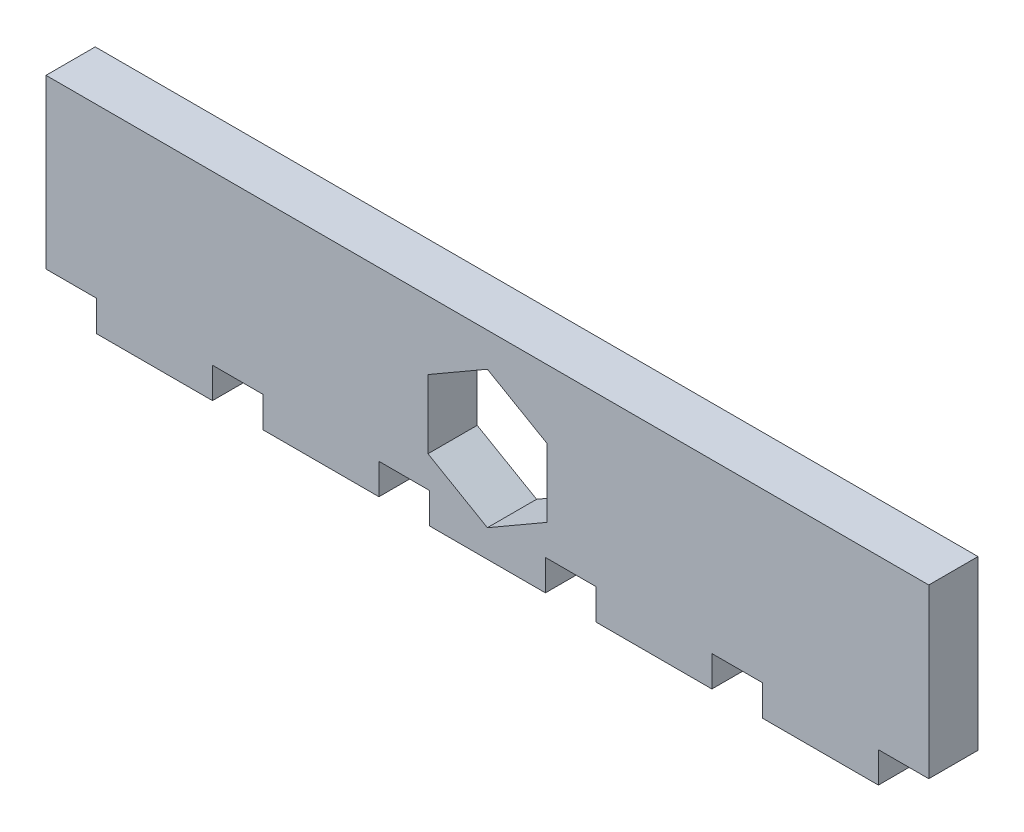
ISO-10303-21;
HEADER;
FILE_DESCRIPTION(('STEP AP214'),'2;1');
FILE_NAME('part.step','',(''),(''),'','','');
FILE_SCHEMA(('AUTOMOTIVE_DESIGN { 1 0 10303 214 1 1 1 1 }'));
ENDSEC;
DATA;
#1=APPLICATION_CONTEXT('core data for automotive mechanical design processes');
#2=APPLICATION_PROTOCOL_DEFINITION('international standard','automotive_design',2000,#1);
#3=PRODUCT_CONTEXT('',#1,'mechanical');
#4=PRODUCT('Part','Part','',(#3));
#5=PRODUCT_RELATED_PRODUCT_CATEGORY('part','',(#4));
#6=PRODUCT_DEFINITION_FORMATION('','',#4);
#7=PRODUCT_DEFINITION_CONTEXT('part definition',#1,'design');
#8=PRODUCT_DEFINITION('design','',#6,#7);
#9=PRODUCT_DEFINITION_SHAPE('','',#8);
#10=(LENGTH_UNIT() NAMED_UNIT(*) SI_UNIT(.MILLI.,.METRE.));
#11=(NAMED_UNIT(*) PLANE_ANGLE_UNIT() SI_UNIT($,.RADIAN.));
#12=(NAMED_UNIT(*) SI_UNIT($,.STERADIAN.) SOLID_ANGLE_UNIT());
#13=UNCERTAINTY_MEASURE_WITH_UNIT(LENGTH_MEASURE(1.E-05),#10,'distance_accuracy_value','');
#14=(GEOMETRIC_REPRESENTATION_CONTEXT(3) GLOBAL_UNCERTAINTY_ASSIGNED_CONTEXT((#13)) GLOBAL_UNIT_ASSIGNED_CONTEXT((#10,
#11,#12)) REPRESENTATION_CONTEXT('',''));
#15=CARTESIAN_POINT('',(0.,0.,0.));
#16=DIRECTION('',(0.,0.,1.));
#17=DIRECTION('',(1.,0.,0.));
#18=AXIS2_PLACEMENT_3D('',#15,#16,#17);
#19=CARTESIAN_POINT('',(0.,0.,5.3848));
#20=DIRECTION('',(0.,0.,-1.));
#21=DIRECTION('',(-1.,0.,0.));
#22=AXIS2_PLACEMENT_3D('',#19,#20,#21);
#23=PLANE('',#22);
#24=DIRECTION('',(0.,1.,0.));
#25=VECTOR('',#24,1.);
#26=CARTESIAN_POINT('',(209.670480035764,240.672505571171,5.3848));
#27=LINE('',#26,#25);
#28=CARTESIAN_POINT('',(209.670480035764,237.313031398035,5.3848));
#29=VERTEX_POINT('',#28);
#30=CARTESIAN_POINT('',(209.670480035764,240.672505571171,5.3848));
#31=VERTEX_POINT('',#30);
#32=EDGE_CURVE('E280',#29,#31,#27,.T.);
#33=ORIENTED_EDGE('',*,*,#32,.T.);
#34=DIRECTION('',(1.,0.,0.));
#35=VECTOR('',#34,1.);
#36=CARTESIAN_POINT('',(215.182280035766,240.672505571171,5.3848));
#37=LINE('',#36,#35);
#38=CARTESIAN_POINT('',(215.182280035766,240.672505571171,5.3848));
#39=VERTEX_POINT('',#38);
#40=EDGE_CURVE('E283',#31,#39,#37,.T.);
#41=ORIENTED_EDGE('',*,*,#40,.T.);
#42=DIRECTION('',(0.,1.,0.));
#43=VECTOR('',#42,1.);
#44=CARTESIAN_POINT('',(215.182280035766,240.672505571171,5.3848));
#45=LINE('',#44,#43);
#46=CARTESIAN_POINT('',(215.182280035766,259.030257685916,5.3848));
#47=VERTEX_POINT('',#46);
#48=EDGE_CURVE('E286',#39,#47,#45,.T.);
#49=ORIENTED_EDGE('',*,*,#48,.T.);
#50=DIRECTION('',(-1.,0.,0.));
#51=VECTOR('',#50,1.);
#52=CARTESIAN_POINT('',(215.182280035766,259.030257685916,5.3848));
#53=LINE('',#52,#51);
#54=CARTESIAN_POINT('',(118.611480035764,259.030257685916,5.3848));
#55=VERTEX_POINT('',#54);
#56=EDGE_CURVE('E288',#47,#55,#53,.T.);
#57=ORIENTED_EDGE('',*,*,#56,.T.);
#58=DIRECTION('',(0.,-1.,0.));
#59=VECTOR('',#58,1.);
#60=CARTESIAN_POINT('',(118.611480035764,240.672505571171,5.3848));
#61=LINE('',#60,#59);
#62=CARTESIAN_POINT('',(118.611480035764,240.672505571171,5.3848));
#63=VERTEX_POINT('',#62);
#64=EDGE_CURVE('E290',#55,#63,#61,.T.);
#65=ORIENTED_EDGE('',*,*,#64,.T.);
#66=DIRECTION('',(1.,0.,0.));
#67=VECTOR('',#66,1.);
#68=CARTESIAN_POINT('',(124.123280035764,240.672505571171,5.3848));
#69=LINE('',#68,#67);
#70=CARTESIAN_POINT('',(124.123280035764,240.672505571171,5.3848));
#71=VERTEX_POINT('',#70);
#72=EDGE_CURVE('E292',#63,#71,#69,.T.);
#73=ORIENTED_EDGE('',*,*,#72,.T.);
#74=DIRECTION('',(0.,-1.,0.));
#75=VECTOR('',#74,1.);
#76=CARTESIAN_POINT('',(124.123280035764,237.313031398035,5.3848));
#77=LINE('',#76,#75);
#78=CARTESIAN_POINT('',(124.123280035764,237.313031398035,5.3848));
#79=VERTEX_POINT('',#78);
#80=EDGE_CURVE('E294',#71,#79,#77,.T.);
#81=ORIENTED_EDGE('',*,*,#80,.T.);
#82=DIRECTION('',(1.,0.,0.));
#83=VECTOR('',#82,1.);
#84=CARTESIAN_POINT('',(136.823280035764,237.313031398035,5.3848));
#85=LINE('',#84,#83);
#86=CARTESIAN_POINT('',(136.823280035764,237.313031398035,5.3848));
#87=VERTEX_POINT('',#86);
#88=EDGE_CURVE('E296',#79,#87,#85,.T.);
#89=ORIENTED_EDGE('',*,*,#88,.T.);
#90=DIRECTION('',(0.,1.,0.));
#91=VECTOR('',#90,1.);
#92=CARTESIAN_POINT('',(136.823280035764,240.672505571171,5.3848));
#93=LINE('',#92,#91);
#94=CARTESIAN_POINT('',(136.823280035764,240.672505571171,5.3848));
#95=VERTEX_POINT('',#94);
#96=EDGE_CURVE('E298',#87,#95,#93,.T.);
#97=ORIENTED_EDGE('',*,*,#96,.T.);
#98=DIRECTION('',(1.,0.,0.));
#99=VECTOR('',#98,1.);
#100=CARTESIAN_POINT('',(142.335080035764,240.672505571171,5.3848));
#101=LINE('',#100,#99);
#102=CARTESIAN_POINT('',(142.335080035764,240.672505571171,5.3848));
#103=VERTEX_POINT('',#102);
#104=EDGE_CURVE('E300',#95,#103,#101,.T.);
#105=ORIENTED_EDGE('',*,*,#104,.T.);
#106=DIRECTION('',(0.,-1.,0.));
#107=VECTOR('',#106,1.);
#108=CARTESIAN_POINT('',(142.335080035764,237.313031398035,5.3848));
#109=LINE('',#108,#107);
#110=CARTESIAN_POINT('',(142.335080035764,237.313031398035,5.3848));
#111=VERTEX_POINT('',#110);
#112=EDGE_CURVE('E302',#103,#111,#109,.T.);
#113=ORIENTED_EDGE('',*,*,#112,.T.);
#114=DIRECTION('',(1.,0.,0.));
#115=VECTOR('',#114,1.);
#116=CARTESIAN_POINT('',(155.035080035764,237.313031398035,5.3848));
#117=LINE('',#116,#115);
#118=CARTESIAN_POINT('',(155.035080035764,237.313031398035,5.3848));
#119=VERTEX_POINT('',#118);
#120=EDGE_CURVE('E304',#111,#119,#117,.T.);
#121=ORIENTED_EDGE('',*,*,#120,.T.);
#122=DIRECTION('',(0.,1.,0.));
#123=VECTOR('',#122,1.);
#124=CARTESIAN_POINT('',(155.035080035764,240.672505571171,5.3848));
#125=LINE('',#124,#123);
#126=CARTESIAN_POINT('',(155.035080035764,240.672505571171,5.3848));
#127=VERTEX_POINT('',#126);
#128=EDGE_CURVE('E306',#119,#127,#125,.T.);
#129=ORIENTED_EDGE('',*,*,#128,.T.);
#130=DIRECTION('',(1.,0.,0.));
#131=VECTOR('',#130,1.);
#132=CARTESIAN_POINT('',(160.546880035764,240.672505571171,5.3848));
#133=LINE('',#132,#131);
#134=CARTESIAN_POINT('',(160.546880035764,240.672505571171,5.3848));
#135=VERTEX_POINT('',#134);
#136=EDGE_CURVE('E308',#127,#135,#133,.T.);
#137=ORIENTED_EDGE('',*,*,#136,.T.);
#138=DIRECTION('',(0.,-1.,0.));
#139=VECTOR('',#138,1.);
#140=CARTESIAN_POINT('',(160.546880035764,237.313031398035,5.3848));
#141=LINE('',#140,#139);
#142=CARTESIAN_POINT('',(160.546880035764,237.313031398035,5.3848));
#143=VERTEX_POINT('',#142);
#144=EDGE_CURVE('E310',#135,#143,#141,.T.);
#145=ORIENTED_EDGE('',*,*,#144,.T.);
#146=DIRECTION('',(1.,0.,0.));
#147=VECTOR('',#146,1.);
#148=CARTESIAN_POINT('',(173.246880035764,237.313031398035,5.3848));
#149=LINE('',#148,#147);
#150=CARTESIAN_POINT('',(173.246880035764,237.313031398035,5.3848));
#151=VERTEX_POINT('',#150);
#152=EDGE_CURVE('E312',#143,#151,#149,.T.);
#153=ORIENTED_EDGE('',*,*,#152,.T.);
#154=DIRECTION('',(0.,1.,0.));
#155=VECTOR('',#154,1.);
#156=CARTESIAN_POINT('',(173.246880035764,240.672505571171,5.3848));
#157=LINE('',#156,#155);
#158=CARTESIAN_POINT('',(173.246880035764,240.672505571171,5.3848));
#159=VERTEX_POINT('',#158);
#160=EDGE_CURVE('E314',#151,#159,#157,.T.);
#161=ORIENTED_EDGE('',*,*,#160,.T.);
#162=DIRECTION('',(1.,0.,0.));
#163=VECTOR('',#162,1.);
#164=CARTESIAN_POINT('',(178.758680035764,240.672505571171,5.3848));
#165=LINE('',#164,#163);
#166=CARTESIAN_POINT('',(178.758680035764,240.672505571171,5.3848));
#167=VERTEX_POINT('',#166);
#168=EDGE_CURVE('E316',#159,#167,#165,.T.);
#169=ORIENTED_EDGE('',*,*,#168,.T.);
#170=DIRECTION('',(0.,-1.,0.));
#171=VECTOR('',#170,1.);
#172=CARTESIAN_POINT('',(178.758680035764,237.313031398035,5.3848));
#173=LINE('',#172,#171);
#174=CARTESIAN_POINT('',(178.758680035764,237.313031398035,5.3848));
#175=VERTEX_POINT('',#174);
#176=EDGE_CURVE('E318',#167,#175,#173,.T.);
#177=ORIENTED_EDGE('',*,*,#176,.T.);
#178=DIRECTION('',(1.,0.,0.));
#179=VECTOR('',#178,1.);
#180=CARTESIAN_POINT('',(191.458680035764,237.313031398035,5.3848));
#181=LINE('',#180,#179);
#182=CARTESIAN_POINT('',(191.458680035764,237.313031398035,5.3848));
#183=VERTEX_POINT('',#182);
#184=EDGE_CURVE('E320',#175,#183,#181,.T.);
#185=ORIENTED_EDGE('',*,*,#184,.T.);
#186=DIRECTION('',(0.,1.,0.));
#187=VECTOR('',#186,1.);
#188=CARTESIAN_POINT('',(191.458680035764,240.672505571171,5.3848));
#189=LINE('',#188,#187);
#190=CARTESIAN_POINT('',(191.458680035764,240.672505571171,5.3848));
#191=VERTEX_POINT('',#190);
#192=EDGE_CURVE('E322',#183,#191,#189,.T.);
#193=ORIENTED_EDGE('',*,*,#192,.T.);
#194=DIRECTION('',(1.,0.,0.));
#195=VECTOR('',#194,1.);
#196=CARTESIAN_POINT('',(196.970480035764,240.672505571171,5.3848));
#197=LINE('',#196,#195);
#198=CARTESIAN_POINT('',(196.970480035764,240.672505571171,5.3848));
#199=VERTEX_POINT('',#198);
#200=EDGE_CURVE('E324',#191,#199,#197,.T.);
#201=ORIENTED_EDGE('',*,*,#200,.T.);
#202=DIRECTION('',(0.,-1.,0.));
#203=VECTOR('',#202,1.);
#204=CARTESIAN_POINT('',(196.970480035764,237.313031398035,5.3848));
#205=LINE('',#204,#203);
#206=CARTESIAN_POINT('',(196.970480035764,237.313031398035,5.3848));
#207=VERTEX_POINT('',#206);
#208=EDGE_CURVE('E326',#199,#207,#205,.T.);
#209=ORIENTED_EDGE('',*,*,#208,.T.);
#210=DIRECTION('',(1.,0.,0.));
#211=VECTOR('',#210,1.);
#212=CARTESIAN_POINT('',(209.670480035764,237.313031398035,5.3848));
#213=LINE('',#212,#211);
#214=EDGE_CURVE('E328',#207,#29,#213,.T.);
#215=ORIENTED_EDGE('',*,*,#214,.T.);
#216=EDGE_LOOP('',(#33,#41,#49,#57,#65,#73,#81,#89,#97,#105,#113,#121,#129,#137,#145,#153,#161,
#169,#177,#185,#193,#201,#209,#215));
#217=FACE_BOUND('',#216,.T.);
#218=DIRECTION('',(-0.866025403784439,0.5,0.));
#219=VECTOR('',#218,1.);
#220=CARTESIAN_POINT('',(173.396880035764,251.573156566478,5.3848));
#221=LINE('',#220,#219);
#222=CARTESIAN_POINT('',(173.396880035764,251.573156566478,5.3848));
#223=VERTEX_POINT('',#222);
#224=CARTESIAN_POINT('',(166.896880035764,255.32593331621,5.3848));
#225=VERTEX_POINT('',#224);
#226=EDGE_CURVE('E229',#223,#225,#221,.T.);
#227=ORIENTED_EDGE('',*,*,#226,.F.);
#228=DIRECTION('',(0.,1.,0.));
#229=VECTOR('',#228,1.);
#230=CARTESIAN_POINT('',(173.396880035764,244.067603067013,5.3848));
#231=LINE('',#230,#229);
#232=CARTESIAN_POINT('',(173.396880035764,244.067603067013,5.3848));
#233=VERTEX_POINT('',#232);
#234=EDGE_CURVE('E258',#233,#223,#231,.T.);
#235=ORIENTED_EDGE('',*,*,#234,.F.);
#236=DIRECTION('',(0.866025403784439,0.5,0.));
#237=VECTOR('',#236,1.);
#238=CARTESIAN_POINT('',(166.896880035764,240.31482631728,5.3848));
#239=LINE('',#238,#237);
#240=CARTESIAN_POINT('',(166.896880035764,240.31482631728,5.3848));
#241=VERTEX_POINT('',#240);
#242=EDGE_CURVE('E256',#241,#233,#239,.T.);
#243=ORIENTED_EDGE('',*,*,#242,.F.);
#244=DIRECTION('',(0.866025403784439,-0.5,0.));
#245=VECTOR('',#244,1.);
#246=CARTESIAN_POINT('',(160.396880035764,244.067603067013,5.3848));
#247=LINE('',#246,#245);
#248=CARTESIAN_POINT('',(160.396880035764,244.067603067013,5.3848));
#249=VERTEX_POINT('',#248);
#250=EDGE_CURVE('E252',#249,#241,#247,.T.);
#251=ORIENTED_EDGE('',*,*,#250,.F.);
#252=DIRECTION('',(0.,-1.,0.));
#253=VECTOR('',#252,1.);
#254=CARTESIAN_POINT('',(160.396880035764,251.573156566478,5.3848));
#255=LINE('',#254,#253);
#256=CARTESIAN_POINT('',(160.396880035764,251.573156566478,5.3848));
#257=VERTEX_POINT('',#256);
#258=EDGE_CURVE('E250',#257,#249,#255,.T.);
#259=ORIENTED_EDGE('',*,*,#258,.F.);
#260=DIRECTION('',(-0.866025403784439,-0.5,0.));
#261=VECTOR('',#260,1.);
#262=CARTESIAN_POINT('',(166.896880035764,255.32593331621,5.3848));
#263=LINE('',#262,#261);
#264=EDGE_CURVE('E237',#225,#257,#263,.T.);
#265=ORIENTED_EDGE('',*,*,#264,.F.);
#266=EDGE_LOOP('',(#227,#235,#243,#251,#259,#265));
#267=FACE_BOUND('',#266,.T.);
#268=ADVANCED_FACE('F32',(#217,#267),#23,.F.);
#269=CARTESIAN_POINT('',(0.,0.,0.));
#270=DIRECTION('',(0.,0.,-1.));
#271=DIRECTION('',(-1.,0.,0.));
#272=AXIS2_PLACEMENT_3D('',#269,#270,#271);
#273=PLANE('',#272);
#274=DIRECTION('',(0.,1.,0.));
#275=VECTOR('',#274,1.);
#276=CARTESIAN_POINT('',(209.670480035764,240.672505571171,0.));
#277=LINE('',#276,#275);
#278=CARTESIAN_POINT('',(209.670480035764,237.313031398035,0.));
#279=VERTEX_POINT('',#278);
#280=CARTESIAN_POINT('',(209.670480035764,240.672505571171,0.));
#281=VERTEX_POINT('',#280);
#282=EDGE_CURVE('E245',#279,#281,#277,.T.);
#283=ORIENTED_EDGE('',*,*,#282,.F.);
#284=DIRECTION('',(1.,0.,0.));
#285=VECTOR('',#284,1.);
#286=CARTESIAN_POINT('',(209.670480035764,237.313031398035,0.));
#287=LINE('',#286,#285);
#288=CARTESIAN_POINT('',(196.970480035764,237.313031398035,0.));
#289=VERTEX_POINT('',#288);
#290=EDGE_CURVE('E284',#289,#279,#287,.T.);
#291=ORIENTED_EDGE('',*,*,#290,.F.);
#292=DIRECTION('',(0.,-1.,0.));
#293=VECTOR('',#292,1.);
#294=CARTESIAN_POINT('',(196.970480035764,237.313031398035,0.));
#295=LINE('',#294,#293);
#296=CARTESIAN_POINT('',(196.970480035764,240.672505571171,0.));
#297=VERTEX_POINT('',#296);
#298=EDGE_CURVE('E375',#297,#289,#295,.T.);
#299=ORIENTED_EDGE('',*,*,#298,.F.);
#300=DIRECTION('',(1.,0.,0.));
#301=VECTOR('',#300,1.);
#302=CARTESIAN_POINT('',(196.970480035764,240.672505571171,0.));
#303=LINE('',#302,#301);
#304=CARTESIAN_POINT('',(191.458680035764,240.672505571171,0.));
#305=VERTEX_POINT('',#304);
#306=EDGE_CURVE('E373',#305,#297,#303,.T.);
#307=ORIENTED_EDGE('',*,*,#306,.F.);
#308=DIRECTION('',(0.,1.,0.));
#309=VECTOR('',#308,1.);
#310=CARTESIAN_POINT('',(191.458680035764,240.672505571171,0.));
#311=LINE('',#310,#309);
#312=CARTESIAN_POINT('',(191.458680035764,237.313031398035,0.));
#313=VERTEX_POINT('',#312);
#314=EDGE_CURVE('E371',#313,#305,#311,.T.);
#315=ORIENTED_EDGE('',*,*,#314,.F.);
#316=DIRECTION('',(1.,0.,0.));
#317=VECTOR('',#316,1.);
#318=CARTESIAN_POINT('',(191.458680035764,237.313031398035,0.));
#319=LINE('',#318,#317);
#320=CARTESIAN_POINT('',(178.758680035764,237.313031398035,0.));
#321=VERTEX_POINT('',#320);
#322=EDGE_CURVE('E369',#321,#313,#319,.T.);
#323=ORIENTED_EDGE('',*,*,#322,.F.);
#324=DIRECTION('',(0.,-1.,0.));
#325=VECTOR('',#324,1.);
#326=CARTESIAN_POINT('',(178.758680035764,237.313031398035,0.));
#327=LINE('',#326,#325);
#328=CARTESIAN_POINT('',(178.758680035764,240.672505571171,0.));
#329=VERTEX_POINT('',#328);
#330=EDGE_CURVE('E367',#329,#321,#327,.T.);
#331=ORIENTED_EDGE('',*,*,#330,.F.);
#332=DIRECTION('',(1.,0.,0.));
#333=VECTOR('',#332,1.);
#334=CARTESIAN_POINT('',(178.758680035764,240.672505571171,0.));
#335=LINE('',#334,#333);
#336=CARTESIAN_POINT('',(173.246880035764,240.672505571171,0.));
#337=VERTEX_POINT('',#336);
#338=EDGE_CURVE('E365',#337,#329,#335,.T.);
#339=ORIENTED_EDGE('',*,*,#338,.F.);
#340=DIRECTION('',(0.,1.,0.));
#341=VECTOR('',#340,1.);
#342=CARTESIAN_POINT('',(173.246880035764,240.672505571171,0.));
#343=LINE('',#342,#341);
#344=CARTESIAN_POINT('',(173.246880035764,237.313031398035,0.));
#345=VERTEX_POINT('',#344);
#346=EDGE_CURVE('E363',#345,#337,#343,.T.);
#347=ORIENTED_EDGE('',*,*,#346,.F.);
#348=DIRECTION('',(1.,0.,0.));
#349=VECTOR('',#348,1.);
#350=CARTESIAN_POINT('',(173.246880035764,237.313031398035,0.));
#351=LINE('',#350,#349);
#352=CARTESIAN_POINT('',(160.546880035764,237.313031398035,0.));
#353=VERTEX_POINT('',#352);
#354=EDGE_CURVE('E361',#353,#345,#351,.T.);
#355=ORIENTED_EDGE('',*,*,#354,.F.);
#356=DIRECTION('',(0.,-1.,0.));
#357=VECTOR('',#356,1.);
#358=CARTESIAN_POINT('',(160.546880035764,237.313031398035,0.));
#359=LINE('',#358,#357);
#360=CARTESIAN_POINT('',(160.546880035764,240.672505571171,0.));
#361=VERTEX_POINT('',#360);
#362=EDGE_CURVE('E359',#361,#353,#359,.T.);
#363=ORIENTED_EDGE('',*,*,#362,.F.);
#364=DIRECTION('',(1.,0.,0.));
#365=VECTOR('',#364,1.);
#366=CARTESIAN_POINT('',(160.546880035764,240.672505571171,0.));
#367=LINE('',#366,#365);
#368=CARTESIAN_POINT('',(155.035080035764,240.672505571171,0.));
#369=VERTEX_POINT('',#368);
#370=EDGE_CURVE('E357',#369,#361,#367,.T.);
#371=ORIENTED_EDGE('',*,*,#370,.F.);
#372=DIRECTION('',(0.,1.,0.));
#373=VECTOR('',#372,1.);
#374=CARTESIAN_POINT('',(155.035080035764,240.672505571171,0.));
#375=LINE('',#374,#373);
#376=CARTESIAN_POINT('',(155.035080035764,237.313031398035,0.));
#377=VERTEX_POINT('',#376);
#378=EDGE_CURVE('E355',#377,#369,#375,.T.);
#379=ORIENTED_EDGE('',*,*,#378,.F.);
#380=DIRECTION('',(1.,0.,0.));
#381=VECTOR('',#380,1.);
#382=CARTESIAN_POINT('',(155.035080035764,237.313031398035,0.));
#383=LINE('',#382,#381);
#384=CARTESIAN_POINT('',(142.335080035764,237.313031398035,0.));
#385=VERTEX_POINT('',#384);
#386=EDGE_CURVE('E353',#385,#377,#383,.T.);
#387=ORIENTED_EDGE('',*,*,#386,.F.);
#388=DIRECTION('',(0.,-1.,0.));
#389=VECTOR('',#388,1.);
#390=CARTESIAN_POINT('',(142.335080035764,237.313031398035,0.));
#391=LINE('',#390,#389);
#392=CARTESIAN_POINT('',(142.335080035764,240.672505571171,0.));
#393=VERTEX_POINT('',#392);
#394=EDGE_CURVE('E351',#393,#385,#391,.T.);
#395=ORIENTED_EDGE('',*,*,#394,.F.);
#396=DIRECTION('',(1.,0.,0.));
#397=VECTOR('',#396,1.);
#398=CARTESIAN_POINT('',(142.335080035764,240.672505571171,0.));
#399=LINE('',#398,#397);
#400=CARTESIAN_POINT('',(136.823280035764,240.672505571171,0.));
#401=VERTEX_POINT('',#400);
#402=EDGE_CURVE('E349',#401,#393,#399,.T.);
#403=ORIENTED_EDGE('',*,*,#402,.F.);
#404=DIRECTION('',(0.,1.,0.));
#405=VECTOR('',#404,1.);
#406=CARTESIAN_POINT('',(136.823280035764,240.672505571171,0.));
#407=LINE('',#406,#405);
#408=CARTESIAN_POINT('',(136.823280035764,237.313031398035,0.));
#409=VERTEX_POINT('',#408);
#410=EDGE_CURVE('E347',#409,#401,#407,.T.);
#411=ORIENTED_EDGE('',*,*,#410,.F.);
#412=DIRECTION('',(1.,0.,0.));
#413=VECTOR('',#412,1.);
#414=CARTESIAN_POINT('',(136.823280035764,237.313031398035,0.));
#415=LINE('',#414,#413);
#416=CARTESIAN_POINT('',(124.123280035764,237.313031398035,0.));
#417=VERTEX_POINT('',#416);
#418=EDGE_CURVE('E345',#417,#409,#415,.T.);
#419=ORIENTED_EDGE('',*,*,#418,.F.);
#420=DIRECTION('',(0.,-1.,0.));
#421=VECTOR('',#420,1.);
#422=CARTESIAN_POINT('',(124.123280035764,237.313031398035,0.));
#423=LINE('',#422,#421);
#424=CARTESIAN_POINT('',(124.123280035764,240.672505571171,0.));
#425=VERTEX_POINT('',#424);
#426=EDGE_CURVE('E343',#425,#417,#423,.T.);
#427=ORIENTED_EDGE('',*,*,#426,.F.);
#428=DIRECTION('',(1.,0.,0.));
#429=VECTOR('',#428,1.);
#430=CARTESIAN_POINT('',(124.123280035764,240.672505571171,0.));
#431=LINE('',#430,#429);
#432=CARTESIAN_POINT('',(118.611480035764,240.672505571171,0.));
#433=VERTEX_POINT('',#432);
#434=EDGE_CURVE('E341',#433,#425,#431,.T.);
#435=ORIENTED_EDGE('',*,*,#434,.F.);
#436=DIRECTION('',(0.,-1.,0.));
#437=VECTOR('',#436,1.);
#438=CARTESIAN_POINT('',(118.611480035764,240.672505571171,0.));
#439=LINE('',#438,#437);
#440=CARTESIAN_POINT('',(118.611480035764,259.030257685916,0.));
#441=VERTEX_POINT('',#440);
#442=EDGE_CURVE('E339',#441,#433,#439,.T.);
#443=ORIENTED_EDGE('',*,*,#442,.F.);
#444=DIRECTION('',(-1.,0.,0.));
#445=VECTOR('',#444,1.);
#446=CARTESIAN_POINT('',(215.182280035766,259.030257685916,0.));
#447=LINE('',#446,#445);
#448=CARTESIAN_POINT('',(215.182280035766,259.030257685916,0.));
#449=VERTEX_POINT('',#448);
#450=EDGE_CURVE('E337',#449,#441,#447,.T.);
#451=ORIENTED_EDGE('',*,*,#450,.F.);
#452=DIRECTION('',(0.,1.,0.));
#453=VECTOR('',#452,1.);
#454=CARTESIAN_POINT('',(215.182280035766,240.672505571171,0.));
#455=LINE('',#454,#453);
#456=CARTESIAN_POINT('',(215.182280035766,240.672505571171,0.));
#457=VERTEX_POINT('',#456);
#458=EDGE_CURVE('E335',#457,#449,#455,.T.);
#459=ORIENTED_EDGE('',*,*,#458,.F.);
#460=DIRECTION('',(1.,0.,0.));
#461=VECTOR('',#460,1.);
#462=CARTESIAN_POINT('',(215.182280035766,240.672505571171,0.));
#463=LINE('',#462,#461);
#464=EDGE_CURVE('E333',#281,#457,#463,.T.);
#465=ORIENTED_EDGE('',*,*,#464,.F.);
#466=EDGE_LOOP('',(#283,#291,#299,#307,#315,#323,#331,#339,#347,#355,#363,#371,#379,#387,#395,
#403,#411,#419,#427,#435,#443,#451,#459,#465));
#467=FACE_BOUND('',#466,.T.);
#468=DIRECTION('',(0.,1.,0.));
#469=VECTOR('',#468,1.);
#470=CARTESIAN_POINT('',(173.396880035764,244.067603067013,0.));
#471=LINE('',#470,#469);
#472=CARTESIAN_POINT('',(173.396880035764,244.067603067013,0.));
#473=VERTEX_POINT('',#472);
#474=CARTESIAN_POINT('',(173.396880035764,251.573156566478,0.));
#475=VERTEX_POINT('',#474);
#476=EDGE_CURVE('E238',#473,#475,#471,.T.);
#477=ORIENTED_EDGE('',*,*,#476,.T.);
#478=DIRECTION('',(-0.866025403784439,0.5,0.));
#479=VECTOR('',#478,1.);
#480=CARTESIAN_POINT('',(173.396880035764,251.573156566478,0.));
#481=LINE('',#480,#479);
#482=CARTESIAN_POINT('',(166.896880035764,255.32593331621,0.));
#483=VERTEX_POINT('',#482);
#484=EDGE_CURVE('E55',#475,#483,#481,.T.);
#485=ORIENTED_EDGE('',*,*,#484,.T.);
#486=DIRECTION('',(-0.866025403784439,-0.5,0.));
#487=VECTOR('',#486,1.);
#488=CARTESIAN_POINT('',(166.896880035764,255.32593331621,0.));
#489=LINE('',#488,#487);
#490=CARTESIAN_POINT('',(160.396880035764,251.573156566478,0.));
#491=VERTEX_POINT('',#490);
#492=EDGE_CURVE('E244',#483,#491,#489,.T.);
#493=ORIENTED_EDGE('',*,*,#492,.T.);
#494=DIRECTION('',(0.,-1.,0.));
#495=VECTOR('',#494,1.);
#496=CARTESIAN_POINT('',(160.396880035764,251.573156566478,0.));
#497=LINE('',#496,#495);
#498=CARTESIAN_POINT('',(160.396880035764,244.067603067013,0.));
#499=VERTEX_POINT('',#498);
#500=EDGE_CURVE('E262',#491,#499,#497,.T.);
#501=ORIENTED_EDGE('',*,*,#500,.T.);
#502=DIRECTION('',(0.866025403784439,-0.5,0.));
#503=VECTOR('',#502,1.);
#504=CARTESIAN_POINT('',(160.396880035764,244.067603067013,0.));
#505=LINE('',#504,#503);
#506=CARTESIAN_POINT('',(166.896880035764,240.31482631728,0.));
#507=VERTEX_POINT('',#506);
#508=EDGE_CURVE('E265',#499,#507,#505,.T.);
#509=ORIENTED_EDGE('',*,*,#508,.T.);
#510=DIRECTION('',(0.866025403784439,0.5,0.));
#511=VECTOR('',#510,1.);
#512=CARTESIAN_POINT('',(166.896880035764,240.31482631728,0.));
#513=LINE('',#512,#511);
#514=EDGE_CURVE('E268',#507,#473,#513,.T.);
#515=ORIENTED_EDGE('',*,*,#514,.T.);
#516=EDGE_LOOP('',(#477,#485,#493,#501,#509,#515));
#517=FACE_BOUND('',#516,.T.);
#518=ADVANCED_FACE('F453',(#467,#517),#273,.T.);
#519=CARTESIAN_POINT('',(209.670480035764,240.672505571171,5.3848));
#520=DIRECTION('',(-1.,0.,0.));
#521=DIRECTION('',(0.,0.,1.));
#522=AXIS2_PLACEMENT_3D('',#519,#520,#521);
#523=PLANE('',#522);
#524=ORIENTED_EDGE('',*,*,#282,.T.);
#525=DIRECTION('',(0.,0.,-1.));
#526=VECTOR('',#525,1.);
#527=CARTESIAN_POINT('',(209.670480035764,240.672505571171,5.3848));
#528=LINE('',#527,#526);
#529=EDGE_CURVE('E11',#31,#281,#528,.T.);
#530=ORIENTED_EDGE('',*,*,#529,.F.);
#531=ORIENTED_EDGE('',*,*,#32,.F.);
#532=DIRECTION('',(0.,0.,-1.));
#533=VECTOR('',#532,1.);
#534=CARTESIAN_POINT('',(209.670480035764,237.313031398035,5.3848));
#535=LINE('',#534,#533);
#536=EDGE_CURVE('E330',#29,#279,#535,.T.);
#537=ORIENTED_EDGE('',*,*,#536,.T.);
#538=EDGE_LOOP('',(#524,#530,#531,#537));
#539=FACE_BOUND('',#538,.T.);
#540=ADVANCED_FACE('F34',(#539),#523,.F.);
#541=CARTESIAN_POINT('',(215.182280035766,240.672505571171,5.3848));
#542=DIRECTION('',(0.,1.,0.));
#543=DIRECTION('',(-1.,0.,0.));
#544=AXIS2_PLACEMENT_3D('',#541,#542,#543);
#545=PLANE('',#544);
#546=ORIENTED_EDGE('',*,*,#464,.T.);
#547=DIRECTION('',(0.,0.,-1.));
#548=VECTOR('',#547,1.);
#549=CARTESIAN_POINT('',(215.182280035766,240.672505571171,5.3848));
#550=LINE('',#549,#548);
#551=EDGE_CURVE('E40',#39,#457,#550,.T.);
#552=ORIENTED_EDGE('',*,*,#551,.F.);
#553=ORIENTED_EDGE('',*,*,#40,.F.);
#554=ORIENTED_EDGE('',*,*,#529,.T.);
#555=EDGE_LOOP('',(#546,#552,#553,#554));
#556=FACE_BOUND('',#555,.T.);
#557=ADVANCED_FACE('F470',(#556),#545,.F.);
#558=CARTESIAN_POINT('',(215.182280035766,240.672505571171,5.3848));
#559=DIRECTION('',(-1.,0.,0.));
#560=DIRECTION('',(0.,0.,1.));
#561=AXIS2_PLACEMENT_3D('',#558,#559,#560);
#562=PLANE('',#561);
#563=ORIENTED_EDGE('',*,*,#458,.T.);
#564=DIRECTION('',(0.,0.,-1.));
#565=VECTOR('',#564,1.);
#566=CARTESIAN_POINT('',(215.182280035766,259.030257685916,5.3848));
#567=LINE('',#566,#565);
#568=EDGE_CURVE('E440',#47,#449,#567,.T.);
#569=ORIENTED_EDGE('',*,*,#568,.F.);
#570=ORIENTED_EDGE('',*,*,#48,.F.);
#571=ORIENTED_EDGE('',*,*,#551,.T.);
#572=EDGE_LOOP('',(#563,#569,#570,#571));
#573=FACE_BOUND('',#572,.T.);
#574=ADVANCED_FACE('F447',(#573),#562,.F.);
#575=CARTESIAN_POINT('',(215.182280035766,259.030257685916,5.3848));
#576=DIRECTION('',(0.,-1.,0.));
#577=DIRECTION('',(0.,0.,-1.));
#578=AXIS2_PLACEMENT_3D('',#575,#576,#577);
#579=PLANE('',#578);
#580=ORIENTED_EDGE('',*,*,#450,.T.);
#581=DIRECTION('',(0.,0.,-1.));
#582=VECTOR('',#581,1.);
#583=CARTESIAN_POINT('',(118.611480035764,259.030257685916,5.3848));
#584=LINE('',#583,#582);
#585=EDGE_CURVE('E437',#55,#441,#584,.T.);
#586=ORIENTED_EDGE('',*,*,#585,.F.);
#587=ORIENTED_EDGE('',*,*,#56,.F.);
#588=ORIENTED_EDGE('',*,*,#568,.T.);
#589=EDGE_LOOP('',(#580,#586,#587,#588));
#590=FACE_BOUND('',#589,.T.);
#591=ADVANCED_FACE('F459',(#590),#579,.F.);
#592=CARTESIAN_POINT('',(118.611480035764,240.672505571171,5.3848));
#593=DIRECTION('',(1.,0.,0.));
#594=DIRECTION('',(0.,0.,-1.));
#595=AXIS2_PLACEMENT_3D('',#592,#593,#594);
#596=PLANE('',#595);
#597=ORIENTED_EDGE('',*,*,#442,.T.);
#598=DIRECTION('',(0.,0.,-1.));
#599=VECTOR('',#598,1.);
#600=CARTESIAN_POINT('',(118.611480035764,240.672505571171,5.3848));
#601=LINE('',#600,#599);
#602=EDGE_CURVE('E434',#63,#433,#601,.T.);
#603=ORIENTED_EDGE('',*,*,#602,.F.);
#604=ORIENTED_EDGE('',*,*,#64,.F.);
#605=ORIENTED_EDGE('',*,*,#585,.T.);
#606=EDGE_LOOP('',(#597,#603,#604,#605));
#607=FACE_BOUND('',#606,.T.);
#608=ADVANCED_FACE('F463',(#607),#596,.F.);
#609=CARTESIAN_POINT('',(124.123280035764,240.672505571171,5.3848));
#610=DIRECTION('',(0.,1.,0.));
#611=DIRECTION('',(0.,0.,1.));
#612=AXIS2_PLACEMENT_3D('',#609,#610,#611);
#613=PLANE('',#612);
#614=ORIENTED_EDGE('',*,*,#434,.T.);
#615=DIRECTION('',(0.,0.,-1.));
#616=VECTOR('',#615,1.);
#617=CARTESIAN_POINT('',(124.123280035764,240.672505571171,5.3848));
#618=LINE('',#617,#616);
#619=EDGE_CURVE('E431',#71,#425,#618,.T.);
#620=ORIENTED_EDGE('',*,*,#619,.F.);
#621=ORIENTED_EDGE('',*,*,#72,.F.);
#622=ORIENTED_EDGE('',*,*,#602,.T.);
#623=EDGE_LOOP('',(#614,#620,#621,#622));
#624=FACE_BOUND('',#623,.T.);
#625=ADVANCED_FACE('F563',(#624),#613,.F.);
#626=CARTESIAN_POINT('',(124.123280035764,237.313031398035,5.3848));
#627=DIRECTION('',(1.,0.,0.));
#628=DIRECTION('',(0.,0.,-1.));
#629=AXIS2_PLACEMENT_3D('',#626,#627,#628);
#630=PLANE('',#629);
#631=ORIENTED_EDGE('',*,*,#426,.T.);
#632=DIRECTION('',(0.,0.,-1.));
#633=VECTOR('',#632,1.);
#634=CARTESIAN_POINT('',(124.123280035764,237.313031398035,5.3848));
#635=LINE('',#634,#633);
#636=EDGE_CURVE('E428',#79,#417,#635,.T.);
#637=ORIENTED_EDGE('',*,*,#636,.F.);
#638=ORIENTED_EDGE('',*,*,#80,.F.);
#639=ORIENTED_EDGE('',*,*,#619,.T.);
#640=EDGE_LOOP('',(#631,#637,#638,#639));
#641=FACE_BOUND('',#640,.T.);
#642=ADVANCED_FACE('F561',(#641),#630,.F.);
#643=CARTESIAN_POINT('',(136.823280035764,237.313031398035,5.3848));
#644=DIRECTION('',(0.,1.,0.));
#645=DIRECTION('',(0.,0.,1.));
#646=AXIS2_PLACEMENT_3D('',#643,#644,#645);
#647=PLANE('',#646);
#648=ORIENTED_EDGE('',*,*,#418,.T.);
#649=DIRECTION('',(0.,0.,-1.));
#650=VECTOR('',#649,1.);
#651=CARTESIAN_POINT('',(136.823280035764,237.313031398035,5.3848));
#652=LINE('',#651,#650);
#653=EDGE_CURVE('E425',#87,#409,#652,.T.);
#654=ORIENTED_EDGE('',*,*,#653,.F.);
#655=ORIENTED_EDGE('',*,*,#88,.F.);
#656=ORIENTED_EDGE('',*,*,#636,.T.);
#657=EDGE_LOOP('',(#648,#654,#655,#656));
#658=FACE_BOUND('',#657,.T.);
#659=ADVANCED_FACE('F557',(#658),#647,.F.);
#660=CARTESIAN_POINT('',(136.823280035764,240.672505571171,5.3848));
#661=DIRECTION('',(-1.,0.,0.));
#662=DIRECTION('',(0.,0.,1.));
#663=AXIS2_PLACEMENT_3D('',#660,#661,#662);
#664=PLANE('',#663);
#665=ORIENTED_EDGE('',*,*,#410,.T.);
#666=DIRECTION('',(0.,0.,-1.));
#667=VECTOR('',#666,1.);
#668=CARTESIAN_POINT('',(136.823280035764,240.672505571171,5.3848));
#669=LINE('',#668,#667);
#670=EDGE_CURVE('E422',#95,#401,#669,.T.);
#671=ORIENTED_EDGE('',*,*,#670,.F.);
#672=ORIENTED_EDGE('',*,*,#96,.F.);
#673=ORIENTED_EDGE('',*,*,#653,.T.);
#674=EDGE_LOOP('',(#665,#671,#672,#673));
#675=FACE_BOUND('',#674,.T.);
#676=ADVANCED_FACE('F552',(#675),#664,.F.);
#677=CARTESIAN_POINT('',(142.335080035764,240.672505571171,5.3848));
#678=DIRECTION('',(0.,1.,0.));
#679=DIRECTION('',(0.,0.,1.));
#680=AXIS2_PLACEMENT_3D('',#677,#678,#679);
#681=PLANE('',#680);
#682=ORIENTED_EDGE('',*,*,#402,.T.);
#683=DIRECTION('',(0.,0.,-1.));
#684=VECTOR('',#683,1.);
#685=CARTESIAN_POINT('',(142.335080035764,240.672505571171,5.3848));
#686=LINE('',#685,#684);
#687=EDGE_CURVE('E419',#103,#393,#686,.T.);
#688=ORIENTED_EDGE('',*,*,#687,.F.);
#689=ORIENTED_EDGE('',*,*,#104,.F.);
#690=ORIENTED_EDGE('',*,*,#670,.T.);
#691=EDGE_LOOP('',(#682,#688,#689,#690));
#692=FACE_BOUND('',#691,.T.);
#693=ADVANCED_FACE('F546',(#692),#681,.F.);
#694=CARTESIAN_POINT('',(142.335080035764,237.313031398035,5.3848));
#695=DIRECTION('',(1.,0.,0.));
#696=DIRECTION('',(0.,0.,-1.));
#697=AXIS2_PLACEMENT_3D('',#694,#695,#696);
#698=PLANE('',#697);
#699=ORIENTED_EDGE('',*,*,#394,.T.);
#700=DIRECTION('',(0.,0.,-1.));
#701=VECTOR('',#700,1.);
#702=CARTESIAN_POINT('',(142.335080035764,237.313031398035,5.3848));
#703=LINE('',#702,#701);
#704=EDGE_CURVE('E416',#111,#385,#703,.T.);
#705=ORIENTED_EDGE('',*,*,#704,.F.);
#706=ORIENTED_EDGE('',*,*,#112,.F.);
#707=ORIENTED_EDGE('',*,*,#687,.T.);
#708=EDGE_LOOP('',(#699,#705,#706,#707));
#709=FACE_BOUND('',#708,.T.);
#710=ADVANCED_FACE('F542',(#709),#698,.F.);
#711=CARTESIAN_POINT('',(155.035080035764,237.313031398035,5.3848));
#712=DIRECTION('',(0.,1.,0.));
#713=DIRECTION('',(0.,0.,1.));
#714=AXIS2_PLACEMENT_3D('',#711,#712,#713);
#715=PLANE('',#714);
#716=ORIENTED_EDGE('',*,*,#386,.T.);
#717=DIRECTION('',(0.,0.,-1.));
#718=VECTOR('',#717,1.);
#719=CARTESIAN_POINT('',(155.035080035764,237.313031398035,5.3848));
#720=LINE('',#719,#718);
#721=EDGE_CURVE('E413',#119,#377,#720,.T.);
#722=ORIENTED_EDGE('',*,*,#721,.F.);
#723=ORIENTED_EDGE('',*,*,#120,.F.);
#724=ORIENTED_EDGE('',*,*,#704,.T.);
#725=EDGE_LOOP('',(#716,#722,#723,#724));
#726=FACE_BOUND('',#725,.T.);
#727=ADVANCED_FACE('F537',(#726),#715,.F.);
#728=CARTESIAN_POINT('',(155.035080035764,240.672505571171,5.3848));
#729=DIRECTION('',(-1.,0.,0.));
#730=DIRECTION('',(0.,0.,1.));
#731=AXIS2_PLACEMENT_3D('',#728,#729,#730);
#732=PLANE('',#731);
#733=ORIENTED_EDGE('',*,*,#378,.T.);
#734=DIRECTION('',(0.,0.,-1.));
#735=VECTOR('',#734,1.);
#736=CARTESIAN_POINT('',(155.035080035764,240.672505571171,5.3848));
#737=LINE('',#736,#735);
#738=EDGE_CURVE('E410',#127,#369,#737,.T.);
#739=ORIENTED_EDGE('',*,*,#738,.F.);
#740=ORIENTED_EDGE('',*,*,#128,.F.);
#741=ORIENTED_EDGE('',*,*,#721,.T.);
#742=EDGE_LOOP('',(#733,#739,#740,#741));
#743=FACE_BOUND('',#742,.T.);
#744=ADVANCED_FACE('F531',(#743),#732,.F.);
#745=CARTESIAN_POINT('',(160.546880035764,240.672505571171,5.3848));
#746=DIRECTION('',(0.,1.,0.));
#747=DIRECTION('',(0.,0.,1.));
#748=AXIS2_PLACEMENT_3D('',#745,#746,#747);
#749=PLANE('',#748);
#750=ORIENTED_EDGE('',*,*,#370,.T.);
#751=DIRECTION('',(0.,0.,-1.));
#752=VECTOR('',#751,1.);
#753=CARTESIAN_POINT('',(160.546880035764,240.672505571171,5.3848));
#754=LINE('',#753,#752);
#755=EDGE_CURVE('E407',#135,#361,#754,.T.);
#756=ORIENTED_EDGE('',*,*,#755,.F.);
#757=ORIENTED_EDGE('',*,*,#136,.F.);
#758=ORIENTED_EDGE('',*,*,#738,.T.);
#759=EDGE_LOOP('',(#750,#756,#757,#758));
#760=FACE_BOUND('',#759,.T.);
#761=ADVANCED_FACE('F527',(#760),#749,.F.);
#762=CARTESIAN_POINT('',(160.546880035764,237.313031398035,5.3848));
#763=DIRECTION('',(1.,0.,0.));
#764=DIRECTION('',(0.,0.,-1.));
#765=AXIS2_PLACEMENT_3D('',#762,#763,#764);
#766=PLANE('',#765);
#767=ORIENTED_EDGE('',*,*,#362,.T.);
#768=DIRECTION('',(0.,0.,-1.));
#769=VECTOR('',#768,1.);
#770=CARTESIAN_POINT('',(160.546880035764,237.313031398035,5.3848));
#771=LINE('',#770,#769);
#772=EDGE_CURVE('E404',#143,#353,#771,.T.);
#773=ORIENTED_EDGE('',*,*,#772,.F.);
#774=ORIENTED_EDGE('',*,*,#144,.F.);
#775=ORIENTED_EDGE('',*,*,#755,.T.);
#776=EDGE_LOOP('',(#767,#773,#774,#775));
#777=FACE_BOUND('',#776,.T.);
#778=ADVANCED_FACE('F522',(#777),#766,.F.);
#779=CARTESIAN_POINT('',(173.246880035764,237.313031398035,5.3848));
#780=DIRECTION('',(0.,1.,0.));
#781=DIRECTION('',(0.,0.,1.));
#782=AXIS2_PLACEMENT_3D('',#779,#780,#781);
#783=PLANE('',#782);
#784=ORIENTED_EDGE('',*,*,#354,.T.);
#785=DIRECTION('',(0.,0.,-1.));
#786=VECTOR('',#785,1.);
#787=CARTESIAN_POINT('',(173.246880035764,237.313031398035,5.3848));
#788=LINE('',#787,#786);
#789=EDGE_CURVE('E401',#151,#345,#788,.T.);
#790=ORIENTED_EDGE('',*,*,#789,.F.);
#791=ORIENTED_EDGE('',*,*,#152,.F.);
#792=ORIENTED_EDGE('',*,*,#772,.T.);
#793=EDGE_LOOP('',(#784,#790,#791,#792));
#794=FACE_BOUND('',#793,.T.);
#795=ADVANCED_FACE('F516',(#794),#783,.F.);
#796=CARTESIAN_POINT('',(173.246880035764,240.672505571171,5.3848));
#797=DIRECTION('',(-1.,0.,0.));
#798=DIRECTION('',(0.,0.,1.));
#799=AXIS2_PLACEMENT_3D('',#796,#797,#798);
#800=PLANE('',#799);
#801=ORIENTED_EDGE('',*,*,#346,.T.);
#802=DIRECTION('',(0.,0.,-1.));
#803=VECTOR('',#802,1.);
#804=CARTESIAN_POINT('',(173.246880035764,240.672505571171,5.3848));
#805=LINE('',#804,#803);
#806=EDGE_CURVE('E398',#159,#337,#805,.T.);
#807=ORIENTED_EDGE('',*,*,#806,.F.);
#808=ORIENTED_EDGE('',*,*,#160,.F.);
#809=ORIENTED_EDGE('',*,*,#789,.T.);
#810=EDGE_LOOP('',(#801,#807,#808,#809));
#811=FACE_BOUND('',#810,.T.);
#812=ADVANCED_FACE('F512',(#811),#800,.F.);
#813=CARTESIAN_POINT('',(178.758680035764,240.672505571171,5.3848));
#814=DIRECTION('',(0.,1.,0.));
#815=DIRECTION('',(0.,0.,1.));
#816=AXIS2_PLACEMENT_3D('',#813,#814,#815);
#817=PLANE('',#816);
#818=ORIENTED_EDGE('',*,*,#338,.T.);
#819=DIRECTION('',(0.,0.,-1.));
#820=VECTOR('',#819,1.);
#821=CARTESIAN_POINT('',(178.758680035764,240.672505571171,5.3848));
#822=LINE('',#821,#820);
#823=EDGE_CURVE('E395',#167,#329,#822,.T.);
#824=ORIENTED_EDGE('',*,*,#823,.F.);
#825=ORIENTED_EDGE('',*,*,#168,.F.);
#826=ORIENTED_EDGE('',*,*,#806,.T.);
#827=EDGE_LOOP('',(#818,#824,#825,#826));
#828=FACE_BOUND('',#827,.T.);
#829=ADVANCED_FACE('F507',(#828),#817,.F.);
#830=CARTESIAN_POINT('',(178.758680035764,237.313031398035,5.3848));
#831=DIRECTION('',(1.,0.,0.));
#832=DIRECTION('',(0.,0.,-1.));
#833=AXIS2_PLACEMENT_3D('',#830,#831,#832);
#834=PLANE('',#833);
#835=ORIENTED_EDGE('',*,*,#330,.T.);
#836=DIRECTION('',(0.,0.,-1.));
#837=VECTOR('',#836,1.);
#838=CARTESIAN_POINT('',(178.758680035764,237.313031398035,5.3848));
#839=LINE('',#838,#837);
#840=EDGE_CURVE('E392',#175,#321,#839,.T.);
#841=ORIENTED_EDGE('',*,*,#840,.F.);
#842=ORIENTED_EDGE('',*,*,#176,.F.);
#843=ORIENTED_EDGE('',*,*,#823,.T.);
#844=EDGE_LOOP('',(#835,#841,#842,#843));
#845=FACE_BOUND('',#844,.T.);
#846=ADVANCED_FACE('F501',(#845),#834,.F.);
#847=CARTESIAN_POINT('',(191.458680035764,237.313031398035,5.3848));
#848=DIRECTION('',(0.,1.,0.));
#849=DIRECTION('',(0.,0.,1.));
#850=AXIS2_PLACEMENT_3D('',#847,#848,#849);
#851=PLANE('',#850);
#852=ORIENTED_EDGE('',*,*,#322,.T.);
#853=DIRECTION('',(0.,0.,-1.));
#854=VECTOR('',#853,1.);
#855=CARTESIAN_POINT('',(191.458680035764,237.313031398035,5.3848));
#856=LINE('',#855,#854);
#857=EDGE_CURVE('E389',#183,#313,#856,.T.);
#858=ORIENTED_EDGE('',*,*,#857,.F.);
#859=ORIENTED_EDGE('',*,*,#184,.F.);
#860=ORIENTED_EDGE('',*,*,#840,.T.);
#861=EDGE_LOOP('',(#852,#858,#859,#860));
#862=FACE_BOUND('',#861,.T.);
#863=ADVANCED_FACE('F497',(#862),#851,.F.);
#864=CARTESIAN_POINT('',(191.458680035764,240.672505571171,5.3848));
#865=DIRECTION('',(-1.,0.,0.));
#866=DIRECTION('',(0.,0.,1.));
#867=AXIS2_PLACEMENT_3D('',#864,#865,#866);
#868=PLANE('',#867);
#869=ORIENTED_EDGE('',*,*,#314,.T.);
#870=DIRECTION('',(0.,0.,-1.));
#871=VECTOR('',#870,1.);
#872=CARTESIAN_POINT('',(191.458680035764,240.672505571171,5.3848));
#873=LINE('',#872,#871);
#874=EDGE_CURVE('E386',#191,#305,#873,.T.);
#875=ORIENTED_EDGE('',*,*,#874,.F.);
#876=ORIENTED_EDGE('',*,*,#192,.F.);
#877=ORIENTED_EDGE('',*,*,#857,.T.);
#878=EDGE_LOOP('',(#869,#875,#876,#877));
#879=FACE_BOUND('',#878,.T.);
#880=ADVANCED_FACE('F492',(#879),#868,.F.);
#881=CARTESIAN_POINT('',(196.970480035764,240.672505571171,5.3848));
#882=DIRECTION('',(0.,1.,0.));
#883=DIRECTION('',(0.,0.,1.));
#884=AXIS2_PLACEMENT_3D('',#881,#882,#883);
#885=PLANE('',#884);
#886=ORIENTED_EDGE('',*,*,#306,.T.);
#887=DIRECTION('',(0.,0.,-1.));
#888=VECTOR('',#887,1.);
#889=CARTESIAN_POINT('',(196.970480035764,240.672505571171,5.3848));
#890=LINE('',#889,#888);
#891=EDGE_CURVE('E383',#199,#297,#890,.T.);
#892=ORIENTED_EDGE('',*,*,#891,.F.);
#893=ORIENTED_EDGE('',*,*,#200,.F.);
#894=ORIENTED_EDGE('',*,*,#874,.T.);
#895=EDGE_LOOP('',(#886,#892,#893,#894));
#896=FACE_BOUND('',#895,.T.);
#897=ADVANCED_FACE('F486',(#896),#885,.F.);
#898=CARTESIAN_POINT('',(196.970480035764,237.313031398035,5.3848));
#899=DIRECTION('',(1.,0.,0.));
#900=DIRECTION('',(0.,0.,-1.));
#901=AXIS2_PLACEMENT_3D('',#898,#899,#900);
#902=PLANE('',#901);
#903=ORIENTED_EDGE('',*,*,#298,.T.);
#904=DIRECTION('',(0.,0.,-1.));
#905=VECTOR('',#904,1.);
#906=CARTESIAN_POINT('',(196.970480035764,237.313031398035,5.3848));
#907=LINE('',#906,#905);
#908=EDGE_CURVE('E380',#207,#289,#907,.T.);
#909=ORIENTED_EDGE('',*,*,#908,.F.);
#910=ORIENTED_EDGE('',*,*,#208,.F.);
#911=ORIENTED_EDGE('',*,*,#891,.T.);
#912=EDGE_LOOP('',(#903,#909,#910,#911));
#913=FACE_BOUND('',#912,.T.);
#914=ADVANCED_FACE('F482',(#913),#902,.F.);
#915=CARTESIAN_POINT('',(209.670480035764,237.313031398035,5.3848));
#916=DIRECTION('',(0.,1.,0.));
#917=DIRECTION('',(0.,0.,1.));
#918=AXIS2_PLACEMENT_3D('',#915,#916,#917);
#919=PLANE('',#918);
#920=ORIENTED_EDGE('',*,*,#290,.T.);
#921=ORIENTED_EDGE('',*,*,#536,.F.);
#922=ORIENTED_EDGE('',*,*,#214,.F.);
#923=ORIENTED_EDGE('',*,*,#908,.T.);
#924=EDGE_LOOP('',(#920,#921,#922,#923));
#925=FACE_BOUND('',#924,.T.);
#926=ADVANCED_FACE('F477',(#925),#919,.F.);
#927=CARTESIAN_POINT('',(173.396880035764,251.573156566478,5.3848));
#928=DIRECTION('',(-0.5,-0.866025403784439,0.));
#929=DIRECTION('',(0.866025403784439,-0.5,0.));
#930=AXIS2_PLACEMENT_3D('',#927,#928,#929);
#931=PLANE('',#930);
#932=ORIENTED_EDGE('',*,*,#484,.F.);
#933=DIRECTION('',(0.,0.,-1.));
#934=VECTOR('',#933,1.);
#935=CARTESIAN_POINT('',(173.396880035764,251.573156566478,5.3848));
#936=LINE('',#935,#934);
#937=EDGE_CURVE('E233',#223,#475,#936,.T.);
#938=ORIENTED_EDGE('',*,*,#937,.F.);
#939=ORIENTED_EDGE('',*,*,#226,.T.);
#940=DIRECTION('',(0.,0.,-1.));
#941=VECTOR('',#940,1.);
#942=CARTESIAN_POINT('',(166.896880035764,255.32593331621,5.3848));
#943=LINE('',#942,#941);
#944=EDGE_CURVE('E232',#225,#483,#943,.T.);
#945=ORIENTED_EDGE('',*,*,#944,.T.);
#946=EDGE_LOOP('',(#932,#938,#939,#945));
#947=FACE_BOUND('',#946,.T.);
#948=ADVANCED_FACE('F231',(#947),#931,.T.);
#949=CARTESIAN_POINT('',(166.896880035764,255.32593331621,5.3848));
#950=DIRECTION('',(0.5,-0.866025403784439,0.));
#951=DIRECTION('',(0.866025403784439,0.5,0.));
#952=AXIS2_PLACEMENT_3D('',#949,#950,#951);
#953=PLANE('',#952);
#954=ORIENTED_EDGE('',*,*,#492,.F.);
#955=ORIENTED_EDGE('',*,*,#944,.F.);
#956=ORIENTED_EDGE('',*,*,#264,.T.);
#957=DIRECTION('',(0.,0.,-1.));
#958=VECTOR('',#957,1.);
#959=CARTESIAN_POINT('',(160.396880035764,251.573156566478,5.3848));
#960=LINE('',#959,#958);
#961=EDGE_CURVE('E246',#257,#491,#960,.T.);
#962=ORIENTED_EDGE('',*,*,#961,.T.);
#963=EDGE_LOOP('',(#954,#955,#956,#962));
#964=FACE_BOUND('',#963,.T.);
#965=ADVANCED_FACE('F241',(#964),#953,.T.);
#966=CARTESIAN_POINT('',(160.396880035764,251.573156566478,5.3848));
#967=DIRECTION('',(1.,0.,0.));
#968=DIRECTION('',(0.,0.,-1.));
#969=AXIS2_PLACEMENT_3D('',#966,#967,#968);
#970=PLANE('',#969);
#971=ORIENTED_EDGE('',*,*,#500,.F.);
#972=ORIENTED_EDGE('',*,*,#961,.F.);
#973=ORIENTED_EDGE('',*,*,#258,.T.);
#974=DIRECTION('',(0.,0.,-1.));
#975=VECTOR('',#974,1.);
#976=CARTESIAN_POINT('',(160.396880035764,244.067603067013,5.3848));
#977=LINE('',#976,#975);
#978=EDGE_CURVE('E277',#249,#499,#977,.T.);
#979=ORIENTED_EDGE('',*,*,#978,.T.);
#980=EDGE_LOOP('',(#971,#972,#973,#979));
#981=FACE_BOUND('',#980,.T.);
#982=ADVANCED_FACE('F693',(#981),#970,.T.);
#983=CARTESIAN_POINT('',(160.396880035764,244.067603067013,5.3848));
#984=DIRECTION('',(0.5,0.866025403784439,0.));
#985=DIRECTION('',(-0.866025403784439,0.5,0.));
#986=AXIS2_PLACEMENT_3D('',#983,#984,#985);
#987=PLANE('',#986);
#988=ORIENTED_EDGE('',*,*,#508,.F.);
#989=ORIENTED_EDGE('',*,*,#978,.F.);
#990=ORIENTED_EDGE('',*,*,#250,.T.);
#991=DIRECTION('',(0.,0.,-1.));
#992=VECTOR('',#991,1.);
#993=CARTESIAN_POINT('',(166.896880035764,240.31482631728,5.3848));
#994=LINE('',#993,#992);
#995=EDGE_CURVE('E275',#241,#507,#994,.T.);
#996=ORIENTED_EDGE('',*,*,#995,.T.);
#997=EDGE_LOOP('',(#988,#989,#990,#996));
#998=FACE_BOUND('',#997,.T.);
#999=ADVANCED_FACE('F699',(#998),#987,.T.);
#1000=CARTESIAN_POINT('',(166.896880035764,240.31482631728,5.3848));
#1001=DIRECTION('',(-0.5,0.866025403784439,0.));
#1002=DIRECTION('',(-0.866025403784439,-0.5,0.));
#1003=AXIS2_PLACEMENT_3D('',#1000,#1001,#1002);
#1004=PLANE('',#1003);
#1005=ORIENTED_EDGE('',*,*,#514,.F.);
#1006=ORIENTED_EDGE('',*,*,#995,.F.);
#1007=ORIENTED_EDGE('',*,*,#242,.T.);
#1008=DIRECTION('',(0.,0.,-1.));
#1009=VECTOR('',#1008,1.);
#1010=CARTESIAN_POINT('',(173.396880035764,244.067603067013,5.3848));
#1011=LINE('',#1010,#1009);
#1012=EDGE_CURVE('E47',#233,#473,#1011,.T.);
#1013=ORIENTED_EDGE('',*,*,#1012,.T.);
#1014=EDGE_LOOP('',(#1005,#1006,#1007,#1013));
#1015=FACE_BOUND('',#1014,.T.);
#1016=ADVANCED_FACE('F707',(#1015),#1004,.T.);
#1017=CARTESIAN_POINT('',(173.396880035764,244.067603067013,5.3848));
#1018=DIRECTION('',(-1.,0.,0.));
#1019=DIRECTION('',(0.,0.,1.));
#1020=AXIS2_PLACEMENT_3D('',#1017,#1018,#1019);
#1021=PLANE('',#1020);
#1022=ORIENTED_EDGE('',*,*,#476,.F.);
#1023=ORIENTED_EDGE('',*,*,#1012,.F.);
#1024=ORIENTED_EDGE('',*,*,#234,.T.);
#1025=ORIENTED_EDGE('',*,*,#937,.T.);
#1026=EDGE_LOOP('',(#1022,#1023,#1024,#1025));
#1027=FACE_BOUND('',#1026,.T.);
#1028=ADVANCED_FACE('F715',(#1027),#1021,.T.);
#1029=CLOSED_SHELL('',(#268,#518,#540,#557,#574,#591,#608,#625,#642,#659,#676,#693,#710,#727,
#744,#761,#778,#795,#812,#829,#846,#863,#880,#897,#914,#926,#948,#965,#982,#999,#1016,#1028));
#1030=MANIFOLD_SOLID_BREP('B2',#1029);
#1031=ADVANCED_BREP_SHAPE_REPRESENTATION('',(#18,#1030),#14);
#1032=SHAPE_DEFINITION_REPRESENTATION(#9,#1031);
ENDSEC;
END-ISO-10303-21;
